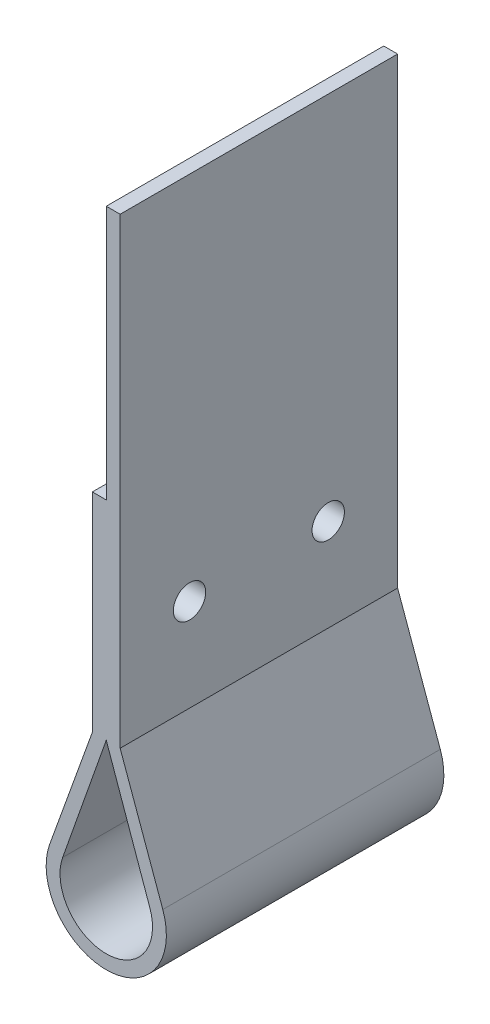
from build123d import *

# Parameters (mm, degrees)
EXTRUSION1_DEPTH = 60
ESQUISSE2_R      = 3.5
EXTRUSION2_DEPTH = 145.069427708


with BuildPart() as part:
    # Esquisse1 → Extrusion1 (new body)
    with BuildSketch(Plane.XY):
        with BuildLine():
            Line((-3, 75), (-3, 30))
            Line((-3, 30), (-12.228984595, 4.410434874))
            ThreePointArc((-12.228984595, 4.410434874), (0, -13), (12.228984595, 4.410434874))
            Line((12.228984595, 4.410434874), (3, 30))
            Line((3, 30), (3, 130))
            Line((3, 130), (0, 130))
            Line((0, 130), (0, 75))
            Line((0, 75), (-3, 75))
        make_face()
        with BuildLine():
            Line((0, 30), (-9.428090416, 3.333333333))
            ThreePointArc((-9.428090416, 3.333333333), (0, -10), (9.428090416, 3.333333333))
            Line((9.428090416, 3.333333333), (0, 30))
        make_face(mode=Mode.SUBTRACT)
    extrude(amount=EXTRUSION1_DEPTH)

    # Esquisse2 → Extrusion2 (cut, through all)
    with BuildSketch(Plane.ZY.offset(3)):
        with Locations(Location((15, 50, 0), (0, 0, 270))):
            Circle(ESQUISSE2_R)
        with Locations(Location((45, 50, 0), (0, 0, 270))):
            Circle(ESQUISSE2_R)
    extrude(amount=-EXTRUSION2_DEPTH, mode=Mode.SUBTRACT)


solid = part.part
